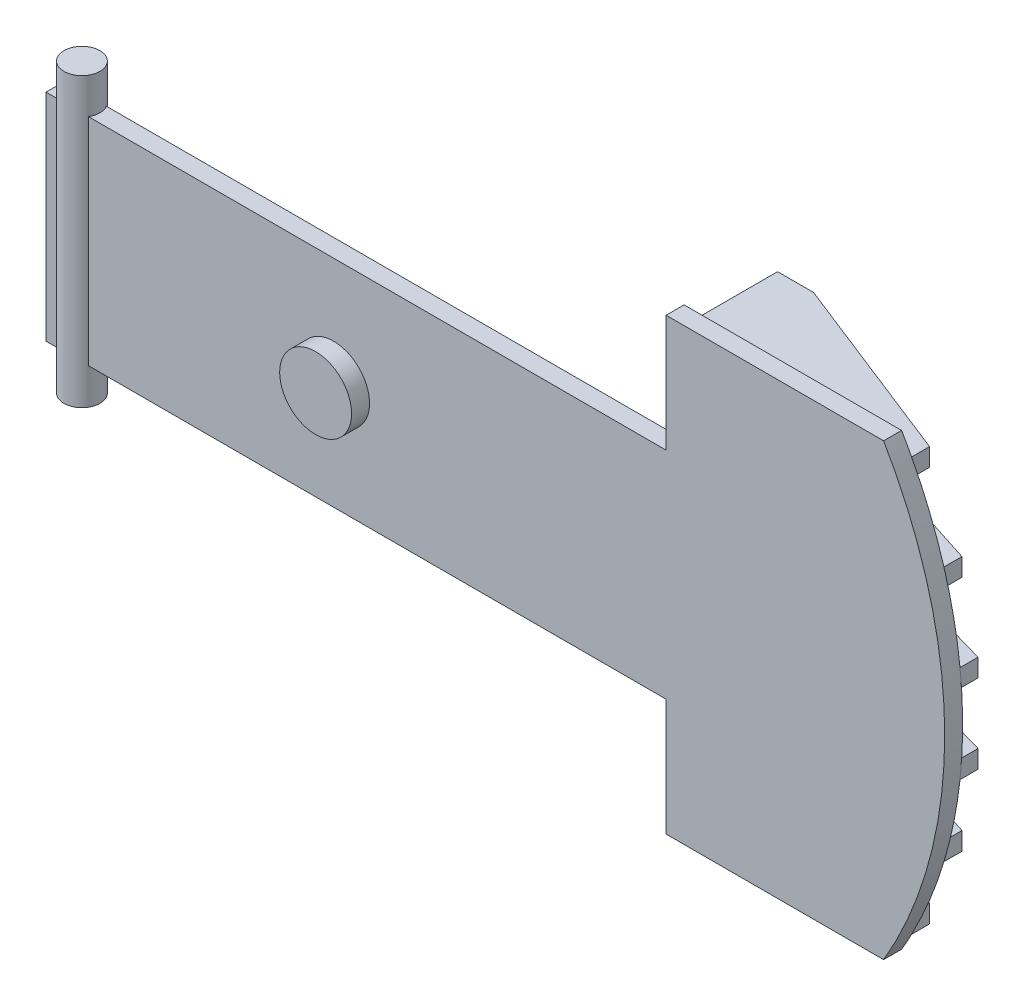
from build123d import *

# Parameters (mm, degrees)
EXTRUSION1_DEPTH      = 1
ESQUISSE2_R           = 2
EXTRUSION2_DEPTH      = 1
EXTRUSION3_DEPTH      = 2
EXTRUSION3_DEPTH_BACK = 14
ESQUISSE3_R           = 1
EXTRUSION4_DEPTH      = 1
EXTRUSION5_DEPTH      = 1
EXTRUSION6_DEPTH      = 1


with BuildPart() as part:
    # Esquisse1 → Extrusion1 (new body)
    with BuildSketch(Plane.XY):
        with BuildLine():
            Line((0, -6), (0, 6))
            Line((0, 6), (34.5, 6))
            Line((34.5, 6), (34.5, 12.5))
            Line((34.5, 12.5), (46.6, 12.5))
            ThreePointArc((46.6, 12.5), (50, 0), (46.6, -12.5))
            Line((46.6, -12.5), (34.5, -12.5))
            Line((34.5, -12.5), (34.5, -6))
            Line((34.5, -6), (0, -6))
        make_face()
    extrude(amount=EXTRUSION1_DEPTH)

    # Esquisse2 → Extrusion2 (add)
    with BuildSketch(Plane.XY.offset(1)):
        with Locations(Location((16, 0, 0), (0, 0, 180))):
            Circle(ESQUISSE2_R)
    extrude(amount=EXTRUSION2_DEPTH)

    # Esquisse3 → Extrusion3 (add, two sides: drawn at the far end of the back side and taken through both)
    with BuildSketch(Plane.XZ.offset(6).offset(-EXTRUSION3_DEPTH_BACK)):
        with Locations(Location((1.5, 0.5, 0), (0, 0, 270))):
            Circle(ESQUISSE3_R)
    extrude(amount=EXTRUSION3_DEPTH + EXTRUSION3_DEPTH_BACK)

    # Esquisse6 → Extrusion4 (add)
    with BuildSketch(Plane(origin=(0, 11.5, 0), x_dir=(-1, 0, 0), z_dir=(0, 1, 0))):
        Polygon((-34.5, 0), (-34.5, -5.2), (-36.5, -5.2), (-47.156682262, -1), (-47.156682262, 0), align=None)
    extrusion4 = extrude(amount=-EXTRUSION4_DEPTH)

    # Esquisse7 → Extrusion5 (add)
    with BuildSketch(Plane(origin=(0, 7.1, 0), x_dir=(-1, 0, 0), z_dir=(0, 1, 0))):
        Polygon((-48.956584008, 0), (-34.5, 0), (-34.5, -5), (-36.5, -5), (-48.956584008, -1), align=None)
    extrusion5 = extrude(amount=-EXTRUSION5_DEPTH)

    # Esquisse8 → Extrusion6 (add)
    with BuildSketch(Plane(origin=(0, 2.7, 0), x_dir=(-1, 0, 0), z_dir=(0, 1, 0))):
        Polygon((-49.851852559, 0), (-34.5, 0), (-34.5, -4.8), (-36.5, -4.8), (-49.851852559, -1), align=None)
    extrusion6 = extrude(amount=-EXTRUSION6_DEPTH)

    # Sym_trie1: Extrusion4, Extrusion5, Extrusion6 across plane
    add(extrusion4.mirror(Plane(origin=(0, 0, 0), x_dir=(0, 0, 1), z_dir=(0, -1, 0))))
    add(extrusion5.mirror(Plane(origin=(0, 0, 0), x_dir=(0, 0, 1), z_dir=(0, -1, 0))))
    add(extrusion6.mirror(Plane(origin=(0, 0, 0), x_dir=(0, 0, 1), z_dir=(0, -1, 0))))


solid = part.part
